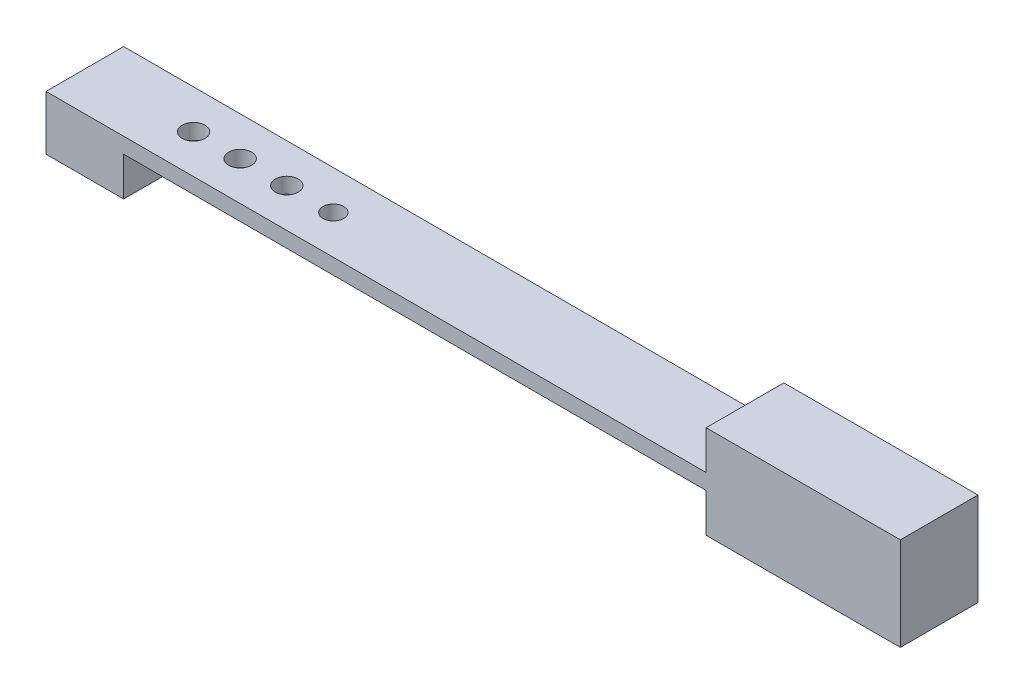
ISO-10303-21;
HEADER;
FILE_DESCRIPTION(('STEP AP214'),'2;1');
FILE_NAME('part.step','',(''),(''),'','','');
FILE_SCHEMA(('AUTOMOTIVE_DESIGN { 1 0 10303 214 1 1 1 1 }'));
ENDSEC;
DATA;
#1=APPLICATION_CONTEXT('core data for automotive mechanical design processes');
#2=APPLICATION_PROTOCOL_DEFINITION('international standard','automotive_design',2000,#1);
#3=PRODUCT_CONTEXT('',#1,'mechanical');
#4=PRODUCT('Part','Part','',(#3));
#5=PRODUCT_RELATED_PRODUCT_CATEGORY('part','',(#4));
#6=PRODUCT_DEFINITION_FORMATION('','',#4);
#7=PRODUCT_DEFINITION_CONTEXT('part definition',#1,'design');
#8=PRODUCT_DEFINITION('design','',#6,#7);
#9=PRODUCT_DEFINITION_SHAPE('','',#8);
#10=(LENGTH_UNIT() NAMED_UNIT(*) SI_UNIT(.MILLI.,.METRE.));
#11=(NAMED_UNIT(*) PLANE_ANGLE_UNIT() SI_UNIT($,.RADIAN.));
#12=(NAMED_UNIT(*) SI_UNIT($,.STERADIAN.) SOLID_ANGLE_UNIT());
#13=UNCERTAINTY_MEASURE_WITH_UNIT(LENGTH_MEASURE(1.E-05),#10,'distance_accuracy_value','');
#14=(GEOMETRIC_REPRESENTATION_CONTEXT(3) GLOBAL_UNCERTAINTY_ASSIGNED_CONTEXT((#13)) GLOBAL_UNIT_ASSIGNED_CONTEXT((#10,
#11,#12)) REPRESENTATION_CONTEXT('',''));
#15=CARTESIAN_POINT('',(0.,0.,0.));
#16=DIRECTION('',(0.,0.,1.));
#17=DIRECTION('',(1.,0.,0.));
#18=AXIS2_PLACEMENT_3D('',#15,#16,#17);
#19=CARTESIAN_POINT('',(0.,0.,0.));
#20=DIRECTION('',(0.,1.,0.));
#21=DIRECTION('',(0.,0.,1.));
#22=AXIS2_PLACEMENT_3D('',#19,#20,#21);
#23=PLANE('',#22);
#24=CARTESIAN_POINT('',(-81.9999999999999,0.,0.));
#25=DIRECTION('',(0.,1.,0.));
#26=DIRECTION('',(0.,0.,1.));
#27=AXIS2_PLACEMENT_3D('',#24,#25,#26);
#28=CIRCLE('',#27,2.95);
#29=CARTESIAN_POINT('',(-81.9999999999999,0.,2.95));
#30=VERTEX_POINT('',#29);
#31=EDGE_CURVE('E186',#30,#30,#28,.T.);
#32=ORIENTED_EDGE('',*,*,#31,.T.);
#33=EDGE_LOOP('',(#32));
#34=FACE_BOUND('',#33,.T.);
#35=CARTESIAN_POINT('',(-46.,0.,0.));
#36=DIRECTION('',(0.,1.,0.));
#37=DIRECTION('',(0.,0.,1.));
#38=AXIS2_PLACEMENT_3D('',#35,#36,#37);
#39=CIRCLE('',#38,2.67545679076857);
#40=CARTESIAN_POINT('',(-46.,0.,2.67545679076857));
#41=VERTEX_POINT('',#40);
#42=EDGE_CURVE('E197',#41,#41,#39,.T.);
#43=ORIENTED_EDGE('',*,*,#42,.T.);
#44=EDGE_LOOP('',(#43));
#45=FACE_BOUND('',#44,.T.);
#46=CARTESIAN_POINT('',(-58.,0.,0.));
#47=DIRECTION('',(0.,1.,0.));
#48=DIRECTION('',(0.,0.,1.));
#49=AXIS2_PLACEMENT_3D('',#46,#47,#48);
#50=CIRCLE('',#49,2.95);
#51=CARTESIAN_POINT('',(-58.,0.,2.95));
#52=VERTEX_POINT('',#51);
#53=EDGE_CURVE('E191',#52,#52,#50,.T.);
#54=ORIENTED_EDGE('',*,*,#53,.T.);
#55=EDGE_LOOP('',(#54));
#56=FACE_BOUND('',#55,.T.);
#57=CARTESIAN_POINT('',(-70.,0.,0.));
#58=DIRECTION('',(0.,1.,0.));
#59=DIRECTION('',(0.,0.,1.));
#60=AXIS2_PLACEMENT_3D('',#57,#58,#59);
#61=CIRCLE('',#60,2.95);
#62=CARTESIAN_POINT('',(-70.,0.,2.95));
#63=VERTEX_POINT('',#62);
#64=EDGE_CURVE('E205',#63,#63,#61,.T.);
#65=ORIENTED_EDGE('',*,*,#64,.T.);
#66=EDGE_LOOP('',(#65));
#67=FACE_BOUND('',#66,.T.);
#68=DIRECTION('',(0.,0.,1.));
#69=VECTOR('',#68,1.);
#70=CARTESIAN_POINT('',(-89.9999999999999,0.,10.));
#71=LINE('',#70,#69);
#72=CARTESIAN_POINT('',(-89.9999999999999,0.,-10.));
#73=VERTEX_POINT('',#72);
#74=CARTESIAN_POINT('',(-89.9999999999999,0.,10.));
#75=VERTEX_POINT('',#74);
#76=EDGE_CURVE('E140',#73,#75,#71,.T.);
#77=ORIENTED_EDGE('',*,*,#76,.F.);
#78=DIRECTION('',(-1.,0.,0.));
#79=VECTOR('',#78,1.);
#80=CARTESIAN_POINT('',(-110.,0.,-10.));
#81=LINE('',#80,#79);
#82=CARTESIAN_POINT('',(60.0000000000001,0.,-10.));
#83=VERTEX_POINT('',#82);
#84=EDGE_CURVE('E208',#83,#73,#81,.T.);
#85=ORIENTED_EDGE('',*,*,#84,.F.);
#86=DIRECTION('',(0.,0.,-1.));
#87=VECTOR('',#86,1.);
#88=CARTESIAN_POINT('',(60.0000000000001,0.,10.));
#89=LINE('',#88,#87);
#90=CARTESIAN_POINT('',(60.0000000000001,0.,10.));
#91=VERTEX_POINT('',#90);
#92=EDGE_CURVE('E148',#91,#83,#89,.T.);
#93=ORIENTED_EDGE('',*,*,#92,.F.);
#94=DIRECTION('',(1.,0.,0.));
#95=VECTOR('',#94,1.);
#96=CARTESIAN_POINT('',(-110.,0.,10.));
#97=LINE('',#96,#95);
#98=EDGE_CURVE('E61',#75,#91,#97,.T.);
#99=ORIENTED_EDGE('',*,*,#98,.F.);
#100=EDGE_LOOP('',(#77,#85,#93,#99));
#101=FACE_BOUND('',#100,.T.);
#102=ADVANCED_FACE('F41',(#34,#45,#56,#67,#101),#23,.F.);
#103=CARTESIAN_POINT('',(110.,4.,-10.));
#104=DIRECTION('',(-1.,0.,0.));
#105=DIRECTION('',(0.,0.,1.));
#106=AXIS2_PLACEMENT_3D('',#103,#104,#105);
#107=PLANE('',#106);
#108=DIRECTION('',(0.,-1.,0.));
#109=VECTOR('',#108,1.);
#110=CARTESIAN_POINT('',(110.,4.,10.));
#111=LINE('',#110,#109);
#112=CARTESIAN_POINT('',(110.,14.,10.));
#113=VERTEX_POINT('',#112);
#114=CARTESIAN_POINT('',(110.,-10.,10.));
#115=VERTEX_POINT('',#114);
#116=EDGE_CURVE('E216',#113,#115,#111,.T.);
#117=ORIENTED_EDGE('',*,*,#116,.T.);
#118=DIRECTION('',(0.,0.,1.));
#119=VECTOR('',#118,1.);
#120=CARTESIAN_POINT('',(110.,-10.,10.));
#121=LINE('',#120,#119);
#122=CARTESIAN_POINT('',(110.,-10.,-10.));
#123=VERTEX_POINT('',#122);
#124=EDGE_CURVE('E149',#123,#115,#121,.T.);
#125=ORIENTED_EDGE('',*,*,#124,.F.);
#126=DIRECTION('',(0.,-1.,0.));
#127=VECTOR('',#126,1.);
#128=CARTESIAN_POINT('',(110.,4.,-10.));
#129=LINE('',#128,#127);
#130=CARTESIAN_POINT('',(110.,14.,-10.));
#131=VERTEX_POINT('',#130);
#132=EDGE_CURVE('E11',#131,#123,#129,.T.);
#133=ORIENTED_EDGE('',*,*,#132,.F.);
#134=DIRECTION('',(0.,0.,-1.));
#135=VECTOR('',#134,1.);
#136=CARTESIAN_POINT('',(110.,14.,-10.));
#137=LINE('',#136,#135);
#138=EDGE_CURVE('E168',#113,#131,#137,.T.);
#139=ORIENTED_EDGE('',*,*,#138,.F.);
#140=EDGE_LOOP('',(#117,#125,#133,#139));
#141=FACE_BOUND('',#140,.T.);
#142=ADVANCED_FACE('F43',(#141),#107,.F.);
#143=CARTESIAN_POINT('',(-110.,4.,-10.));
#144=DIRECTION('',(0.,0.,1.));
#145=DIRECTION('',(1.,0.,0.));
#146=AXIS2_PLACEMENT_3D('',#143,#144,#145);
#147=PLANE('',#146);
#148=ORIENTED_EDGE('',*,*,#132,.T.);
#149=DIRECTION('',(1.,0.,0.));
#150=VECTOR('',#149,1.);
#151=CARTESIAN_POINT('',(110.,-10.,-10.));
#152=LINE('',#151,#150);
#153=CARTESIAN_POINT('',(60.0000000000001,-10.,-10.));
#154=VERTEX_POINT('',#153);
#155=EDGE_CURVE('E156',#154,#123,#152,.T.);
#156=ORIENTED_EDGE('',*,*,#155,.F.);
#157=DIRECTION('',(0.,1.,0.));
#158=VECTOR('',#157,1.);
#159=CARTESIAN_POINT('',(60.0000000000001,-10.,-10.));
#160=LINE('',#159,#158);
#161=EDGE_CURVE('E159',#154,#83,#160,.T.);
#162=ORIENTED_EDGE('',*,*,#161,.T.);
#163=ORIENTED_EDGE('',*,*,#84,.T.);
#164=DIRECTION('',(0.,1.,0.));
#165=VECTOR('',#164,1.);
#166=CARTESIAN_POINT('',(-89.9999999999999,-10.,-10.));
#167=LINE('',#166,#165);
#168=CARTESIAN_POINT('',(-89.9999999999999,-10.,-10.));
#169=VERTEX_POINT('',#168);
#170=EDGE_CURVE('E132',#169,#73,#167,.T.);
#171=ORIENTED_EDGE('',*,*,#170,.F.);
#172=DIRECTION('',(1.,0.,0.));
#173=VECTOR('',#172,1.);
#174=CARTESIAN_POINT('',(-110.,-10.,-10.));
#175=LINE('',#174,#173);
#176=CARTESIAN_POINT('',(-110.,-10.,-10.));
#177=VERTEX_POINT('',#176);
#178=EDGE_CURVE('E129',#177,#169,#175,.T.);
#179=ORIENTED_EDGE('',*,*,#178,.F.);
#180=DIRECTION('',(0.,-1.,0.));
#181=VECTOR('',#180,1.);
#182=CARTESIAN_POINT('',(-110.,4.,-10.));
#183=LINE('',#182,#181);
#184=CARTESIAN_POINT('',(-110.,4.,-10.));
#185=VERTEX_POINT('',#184);
#186=EDGE_CURVE('E49',#185,#177,#183,.T.);
#187=ORIENTED_EDGE('',*,*,#186,.F.);
#188=DIRECTION('',(-1.,0.,0.));
#189=VECTOR('',#188,1.);
#190=CARTESIAN_POINT('',(-110.,4.,-10.));
#191=LINE('',#190,#189);
#192=CARTESIAN_POINT('',(60.,4.,-10.));
#193=VERTEX_POINT('',#192);
#194=EDGE_CURVE('E211',#193,#185,#191,.T.);
#195=ORIENTED_EDGE('',*,*,#194,.F.);
#196=DIRECTION('',(0.,-1.,0.));
#197=VECTOR('',#196,1.);
#198=CARTESIAN_POINT('',(60.0000000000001,14.,-9.99999999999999));
#199=LINE('',#198,#197);
#200=CARTESIAN_POINT('',(60.0000000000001,14.,-9.99999999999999));
#201=VERTEX_POINT('',#200);
#202=EDGE_CURVE('E183',#201,#193,#199,.T.);
#203=ORIENTED_EDGE('',*,*,#202,.F.);
#204=DIRECTION('',(-1.,0.,0.));
#205=VECTOR('',#204,1.);
#206=CARTESIAN_POINT('',(110.,14.,-10.));
#207=LINE('',#206,#205);
#208=EDGE_CURVE('E171',#131,#201,#207,.T.);
#209=ORIENTED_EDGE('',*,*,#208,.F.);
#210=EDGE_LOOP('',(#148,#156,#162,#163,#171,#179,#187,#195,#203,#209));
#211=FACE_BOUND('',#210,.T.);
#212=ADVANCED_FACE('F130',(#211),#147,.F.);
#213=CARTESIAN_POINT('',(-110.,4.,-10.));
#214=DIRECTION('',(1.,0.,0.));
#215=DIRECTION('',(0.,0.,-1.));
#216=AXIS2_PLACEMENT_3D('',#213,#214,#215);
#217=PLANE('',#216);
#218=ORIENTED_EDGE('',*,*,#186,.T.);
#219=DIRECTION('',(0.,0.,-1.));
#220=VECTOR('',#219,1.);
#221=CARTESIAN_POINT('',(-110.,-10.,10.));
#222=LINE('',#221,#220);
#223=CARTESIAN_POINT('',(-110.,-10.,10.));
#224=VERTEX_POINT('',#223);
#225=EDGE_CURVE('E123',#224,#177,#222,.T.);
#226=ORIENTED_EDGE('',*,*,#225,.F.);
#227=DIRECTION('',(0.,-1.,0.));
#228=VECTOR('',#227,1.);
#229=CARTESIAN_POINT('',(-110.,4.,10.));
#230=LINE('',#229,#228);
#231=CARTESIAN_POINT('',(-110.,4.,10.));
#232=VERTEX_POINT('',#231);
#233=EDGE_CURVE('E127',#232,#224,#230,.T.);
#234=ORIENTED_EDGE('',*,*,#233,.F.);
#235=DIRECTION('',(0.,0.,1.));
#236=VECTOR('',#235,1.);
#237=CARTESIAN_POINT('',(-110.,4.,-10.));
#238=LINE('',#237,#236);
#239=EDGE_CURVE('E124',#185,#232,#238,.T.);
#240=ORIENTED_EDGE('',*,*,#239,.F.);
#241=EDGE_LOOP('',(#218,#226,#234,#240));
#242=FACE_BOUND('',#241,.T.);
#243=ADVANCED_FACE('F120',(#242),#217,.F.);
#244=CARTESIAN_POINT('',(-110.,4.,10.));
#245=DIRECTION('',(0.,0.,-1.));
#246=DIRECTION('',(-1.,0.,0.));
#247=AXIS2_PLACEMENT_3D('',#244,#245,#246);
#248=PLANE('',#247);
#249=ORIENTED_EDGE('',*,*,#233,.T.);
#250=DIRECTION('',(-1.,0.,0.));
#251=VECTOR('',#250,1.);
#252=CARTESIAN_POINT('',(-110.,-10.,10.));
#253=LINE('',#252,#251);
#254=CARTESIAN_POINT('',(-89.9999999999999,-10.,10.));
#255=VERTEX_POINT('',#254);
#256=EDGE_CURVE('E139',#255,#224,#253,.T.);
#257=ORIENTED_EDGE('',*,*,#256,.F.);
#258=DIRECTION('',(0.,1.,0.));
#259=VECTOR('',#258,1.);
#260=CARTESIAN_POINT('',(-89.9999999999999,-10.,10.));
#261=LINE('',#260,#259);
#262=EDGE_CURVE('E56',#255,#75,#261,.T.);
#263=ORIENTED_EDGE('',*,*,#262,.T.);
#264=ORIENTED_EDGE('',*,*,#98,.T.);
#265=DIRECTION('',(0.,1.,0.));
#266=VECTOR('',#265,1.);
#267=CARTESIAN_POINT('',(60.0000000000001,-10.,10.));
#268=LINE('',#267,#266);
#269=CARTESIAN_POINT('',(60.0000000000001,-10.,10.));
#270=VERTEX_POINT('',#269);
#271=EDGE_CURVE('E164',#270,#91,#268,.T.);
#272=ORIENTED_EDGE('',*,*,#271,.F.);
#273=DIRECTION('',(-1.,0.,0.));
#274=VECTOR('',#273,1.);
#275=CARTESIAN_POINT('',(110.,-10.,10.));
#276=LINE('',#275,#274);
#277=EDGE_CURVE('E152',#115,#270,#276,.T.);
#278=ORIENTED_EDGE('',*,*,#277,.F.);
#279=ORIENTED_EDGE('',*,*,#116,.F.);
#280=DIRECTION('',(1.,0.,0.));
#281=VECTOR('',#280,1.);
#282=CARTESIAN_POINT('',(110.,14.,10.));
#283=LINE('',#282,#281);
#284=CARTESIAN_POINT('',(60.,14.,10.));
#285=VERTEX_POINT('',#284);
#286=EDGE_CURVE('E175',#285,#113,#283,.T.);
#287=ORIENTED_EDGE('',*,*,#286,.F.);
#288=DIRECTION('',(0.,-1.,0.));
#289=VECTOR('',#288,1.);
#290=CARTESIAN_POINT('',(60.,14.,10.));
#291=LINE('',#290,#289);
#292=CARTESIAN_POINT('',(60.,4.,10.));
#293=VERTEX_POINT('',#292);
#294=EDGE_CURVE('E178',#285,#293,#291,.T.);
#295=ORIENTED_EDGE('',*,*,#294,.T.);
#296=DIRECTION('',(1.,0.,0.));
#297=VECTOR('',#296,1.);
#298=CARTESIAN_POINT('',(-110.,4.,10.));
#299=LINE('',#298,#297);
#300=EDGE_CURVE('E214',#232,#293,#299,.T.);
#301=ORIENTED_EDGE('',*,*,#300,.F.);
#302=EDGE_LOOP('',(#249,#257,#263,#264,#272,#278,#279,#287,#295,#301));
#303=FACE_BOUND('',#302,.T.);
#304=ADVANCED_FACE('F221',(#303),#248,.F.);
#305=CARTESIAN_POINT('',(0.,4.,0.));
#306=DIRECTION('',(0.,1.,0.));
#307=DIRECTION('',(0.,0.,1.));
#308=AXIS2_PLACEMENT_3D('',#305,#306,#307);
#309=PLANE('',#308);
#310=DIRECTION('',(0.,0.,1.));
#311=VECTOR('',#310,1.);
#312=CARTESIAN_POINT('',(60.0000000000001,4.,-9.99999999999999));
#313=LINE('',#312,#311);
#314=EDGE_CURVE('E167',#193,#293,#313,.T.);
#315=ORIENTED_EDGE('',*,*,#314,.F.);
#316=ORIENTED_EDGE('',*,*,#194,.T.);
#317=ORIENTED_EDGE('',*,*,#239,.T.);
#318=ORIENTED_EDGE('',*,*,#300,.T.);
#319=EDGE_LOOP('',(#315,#316,#317,#318));
#320=FACE_BOUND('',#319,.T.);
#321=CARTESIAN_POINT('',(-81.9999999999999,4.,0.));
#322=DIRECTION('',(0.,1.,0.));
#323=DIRECTION('',(0.,0.,1.));
#324=AXIS2_PLACEMENT_3D('',#321,#322,#323);
#325=CIRCLE('',#324,2.95);
#326=CARTESIAN_POINT('',(-81.9999999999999,4.,2.95));
#327=VERTEX_POINT('',#326);
#328=EDGE_CURVE('E200',#327,#327,#325,.T.);
#329=ORIENTED_EDGE('',*,*,#328,.F.);
#330=EDGE_LOOP('',(#329));
#331=FACE_BOUND('',#330,.T.);
#332=CARTESIAN_POINT('',(-46.,4.,0.));
#333=DIRECTION('',(0.,1.,0.));
#334=DIRECTION('',(0.,0.,1.));
#335=AXIS2_PLACEMENT_3D('',#332,#333,#334);
#336=CIRCLE('',#335,2.67545679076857);
#337=CARTESIAN_POINT('',(-46.,4.,2.67545679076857));
#338=VERTEX_POINT('',#337);
#339=EDGE_CURVE('E194',#338,#338,#336,.T.);
#340=ORIENTED_EDGE('',*,*,#339,.F.);
#341=EDGE_LOOP('',(#340));
#342=FACE_BOUND('',#341,.T.);
#343=CARTESIAN_POINT('',(-58.,4.,0.));
#344=DIRECTION('',(0.,1.,0.));
#345=DIRECTION('',(0.,0.,1.));
#346=AXIS2_PLACEMENT_3D('',#343,#344,#345);
#347=CIRCLE('',#346,2.95);
#348=CARTESIAN_POINT('',(-58.,4.,2.95));
#349=VERTEX_POINT('',#348);
#350=EDGE_CURVE('E187',#349,#349,#347,.T.);
#351=ORIENTED_EDGE('',*,*,#350,.F.);
#352=EDGE_LOOP('',(#351));
#353=FACE_BOUND('',#352,.T.);
#354=CARTESIAN_POINT('',(-70.,4.,0.));
#355=DIRECTION('',(0.,1.,0.));
#356=DIRECTION('',(0.,0.,1.));
#357=AXIS2_PLACEMENT_3D('',#354,#355,#356);
#358=CIRCLE('',#357,2.95);
#359=CARTESIAN_POINT('',(-70.,4.,2.95));
#360=VERTEX_POINT('',#359);
#361=EDGE_CURVE('E190',#360,#360,#358,.T.);
#362=ORIENTED_EDGE('',*,*,#361,.F.);
#363=EDGE_LOOP('',(#362));
#364=FACE_BOUND('',#363,.T.);
#365=ADVANCED_FACE('F225',(#320,#331,#342,#353,#364),#309,.T.);
#366=CARTESIAN_POINT('',(-70.,0.,0.));
#367=DIRECTION('',(0.,1.,0.));
#368=DIRECTION('',(0.,0.,1.));
#369=AXIS2_PLACEMENT_3D('',#366,#367,#368);
#370=CYLINDRICAL_SURFACE('',#369,2.95);
#371=ORIENTED_EDGE('',*,*,#64,.F.);
#372=EDGE_LOOP('',(#371));
#373=FACE_BOUND('',#372,.T.);
#374=ORIENTED_EDGE('',*,*,#361,.T.);
#375=EDGE_LOOP('',(#374));
#376=FACE_BOUND('',#375,.T.);
#377=ADVANCED_FACE('F355',(#373,#376),#370,.F.);
#378=CARTESIAN_POINT('',(-58.,0.,0.));
#379=DIRECTION('',(0.,1.,0.));
#380=DIRECTION('',(0.,0.,1.));
#381=AXIS2_PLACEMENT_3D('',#378,#379,#380);
#382=CYLINDRICAL_SURFACE('',#381,2.95);
#383=ORIENTED_EDGE('',*,*,#53,.F.);
#384=EDGE_LOOP('',(#383));
#385=FACE_BOUND('',#384,.T.);
#386=ORIENTED_EDGE('',*,*,#350,.T.);
#387=EDGE_LOOP('',(#386));
#388=FACE_BOUND('',#387,.T.);
#389=ADVANCED_FACE('F346',(#385,#388),#382,.F.);
#390=CARTESIAN_POINT('',(-46.,0.,0.));
#391=DIRECTION('',(0.,1.,0.));
#392=DIRECTION('',(0.,0.,1.));
#393=AXIS2_PLACEMENT_3D('',#390,#391,#392);
#394=CYLINDRICAL_SURFACE('',#393,2.67545679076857);
#395=ORIENTED_EDGE('',*,*,#42,.F.);
#396=EDGE_LOOP('',(#395));
#397=FACE_BOUND('',#396,.T.);
#398=ORIENTED_EDGE('',*,*,#339,.T.);
#399=EDGE_LOOP('',(#398));
#400=FACE_BOUND('',#399,.T.);
#401=ADVANCED_FACE('F336',(#397,#400),#394,.F.);
#402=CARTESIAN_POINT('',(-81.9999999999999,0.,0.));
#403=DIRECTION('',(0.,1.,0.));
#404=DIRECTION('',(0.,0.,1.));
#405=AXIS2_PLACEMENT_3D('',#402,#403,#404);
#406=CYLINDRICAL_SURFACE('',#405,2.95);
#407=ORIENTED_EDGE('',*,*,#31,.F.);
#408=EDGE_LOOP('',(#407));
#409=FACE_BOUND('',#408,.T.);
#410=ORIENTED_EDGE('',*,*,#328,.T.);
#411=EDGE_LOOP('',(#410));
#412=FACE_BOUND('',#411,.T.);
#413=ADVANCED_FACE('F328',(#409,#412),#406,.F.);
#414=CARTESIAN_POINT('',(60.0000000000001,14.,-9.99999999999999));
#415=DIRECTION('',(1.,0.,0.));
#416=DIRECTION('',(0.,0.,-1.));
#417=AXIS2_PLACEMENT_3D('',#414,#415,#416);
#418=PLANE('',#417);
#419=ORIENTED_EDGE('',*,*,#314,.T.);
#420=ORIENTED_EDGE('',*,*,#294,.F.);
#421=DIRECTION('',(0.,0.,1.));
#422=VECTOR('',#421,1.);
#423=CARTESIAN_POINT('',(60.0000000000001,14.,-9.99999999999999));
#424=LINE('',#423,#422);
#425=EDGE_CURVE('E173',#201,#285,#424,.T.);
#426=ORIENTED_EDGE('',*,*,#425,.F.);
#427=ORIENTED_EDGE('',*,*,#202,.T.);
#428=EDGE_LOOP('',(#419,#420,#426,#427));
#429=FACE_BOUND('',#428,.T.);
#430=ADVANCED_FACE('F228',(#429),#418,.F.);
#431=CARTESIAN_POINT('',(0.,14.,0.));
#432=DIRECTION('',(0.,-1.,0.));
#433=DIRECTION('',(0.,0.,-1.));
#434=AXIS2_PLACEMENT_3D('',#431,#432,#433);
#435=PLANE('',#434);
#436=ORIENTED_EDGE('',*,*,#138,.T.);
#437=ORIENTED_EDGE('',*,*,#208,.T.);
#438=ORIENTED_EDGE('',*,*,#425,.T.);
#439=ORIENTED_EDGE('',*,*,#286,.T.);
#440=EDGE_LOOP('',(#436,#437,#438,#439));
#441=FACE_BOUND('',#440,.T.);
#442=ADVANCED_FACE('F235',(#441),#435,.F.);
#443=CARTESIAN_POINT('',(60.0000000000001,-10.,10.));
#444=DIRECTION('',(1.,0.,0.));
#445=DIRECTION('',(0.,0.,-1.));
#446=AXIS2_PLACEMENT_3D('',#443,#444,#445);
#447=PLANE('',#446);
#448=ORIENTED_EDGE('',*,*,#92,.T.);
#449=ORIENTED_EDGE('',*,*,#161,.F.);
#450=DIRECTION('',(0.,0.,-1.));
#451=VECTOR('',#450,1.);
#452=CARTESIAN_POINT('',(60.0000000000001,-10.,10.));
#453=LINE('',#452,#451);
#454=EDGE_CURVE('E154',#270,#154,#453,.T.);
#455=ORIENTED_EDGE('',*,*,#454,.F.);
#456=ORIENTED_EDGE('',*,*,#271,.T.);
#457=EDGE_LOOP('',(#448,#449,#455,#456));
#458=FACE_BOUND('',#457,.T.);
#459=ADVANCED_FACE('F244',(#458),#447,.F.);
#460=CARTESIAN_POINT('',(0.,-10.,0.));
#461=DIRECTION('',(0.,1.,0.));
#462=DIRECTION('',(0.,0.,1.));
#463=AXIS2_PLACEMENT_3D('',#460,#461,#462);
#464=PLANE('',#463);
#465=ORIENTED_EDGE('',*,*,#124,.T.);
#466=ORIENTED_EDGE('',*,*,#277,.T.);
#467=ORIENTED_EDGE('',*,*,#454,.T.);
#468=ORIENTED_EDGE('',*,*,#155,.T.);
#469=EDGE_LOOP('',(#465,#466,#467,#468));
#470=FACE_BOUND('',#469,.T.);
#471=ADVANCED_FACE('F240',(#470),#464,.F.);
#472=CARTESIAN_POINT('',(-89.9999999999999,-10.,10.));
#473=DIRECTION('',(-1.,0.,0.));
#474=DIRECTION('',(0.,0.,1.));
#475=AXIS2_PLACEMENT_3D('',#472,#473,#474);
#476=PLANE('',#475);
#477=ORIENTED_EDGE('',*,*,#76,.T.);
#478=ORIENTED_EDGE('',*,*,#262,.F.);
#479=DIRECTION('',(0.,0.,1.));
#480=VECTOR('',#479,1.);
#481=CARTESIAN_POINT('',(-89.9999999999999,-10.,10.));
#482=LINE('',#481,#480);
#483=EDGE_CURVE('E135',#169,#255,#482,.T.);
#484=ORIENTED_EDGE('',*,*,#483,.F.);
#485=ORIENTED_EDGE('',*,*,#170,.T.);
#486=EDGE_LOOP('',(#477,#478,#484,#485));
#487=FACE_BOUND('',#486,.T.);
#488=ADVANCED_FACE('F248',(#487),#476,.F.);
#489=CARTESIAN_POINT('',(0.,-10.,0.));
#490=DIRECTION('',(0.,-1.,0.));
#491=DIRECTION('',(0.,0.,-1.));
#492=AXIS2_PLACEMENT_3D('',#489,#490,#491);
#493=PLANE('',#492);
#494=ORIENTED_EDGE('',*,*,#225,.T.);
#495=ORIENTED_EDGE('',*,*,#178,.T.);
#496=ORIENTED_EDGE('',*,*,#483,.T.);
#497=ORIENTED_EDGE('',*,*,#256,.T.);
#498=EDGE_LOOP('',(#494,#495,#496,#497));
#499=FACE_BOUND('',#498,.T.);
#500=ADVANCED_FACE('F138',(#499),#493,.T.);
#501=CLOSED_SHELL('',(#102,#142,#212,#243,#304,#365,#377,#389,#401,#413,#430,#442,#459,#471,
#488,#500));
#502=MANIFOLD_SOLID_BREP('B2',#501);
#503=ADVANCED_BREP_SHAPE_REPRESENTATION('',(#18,#502),#14);
#504=SHAPE_DEFINITION_REPRESENTATION(#9,#503);
ENDSEC;
END-ISO-10303-21;
